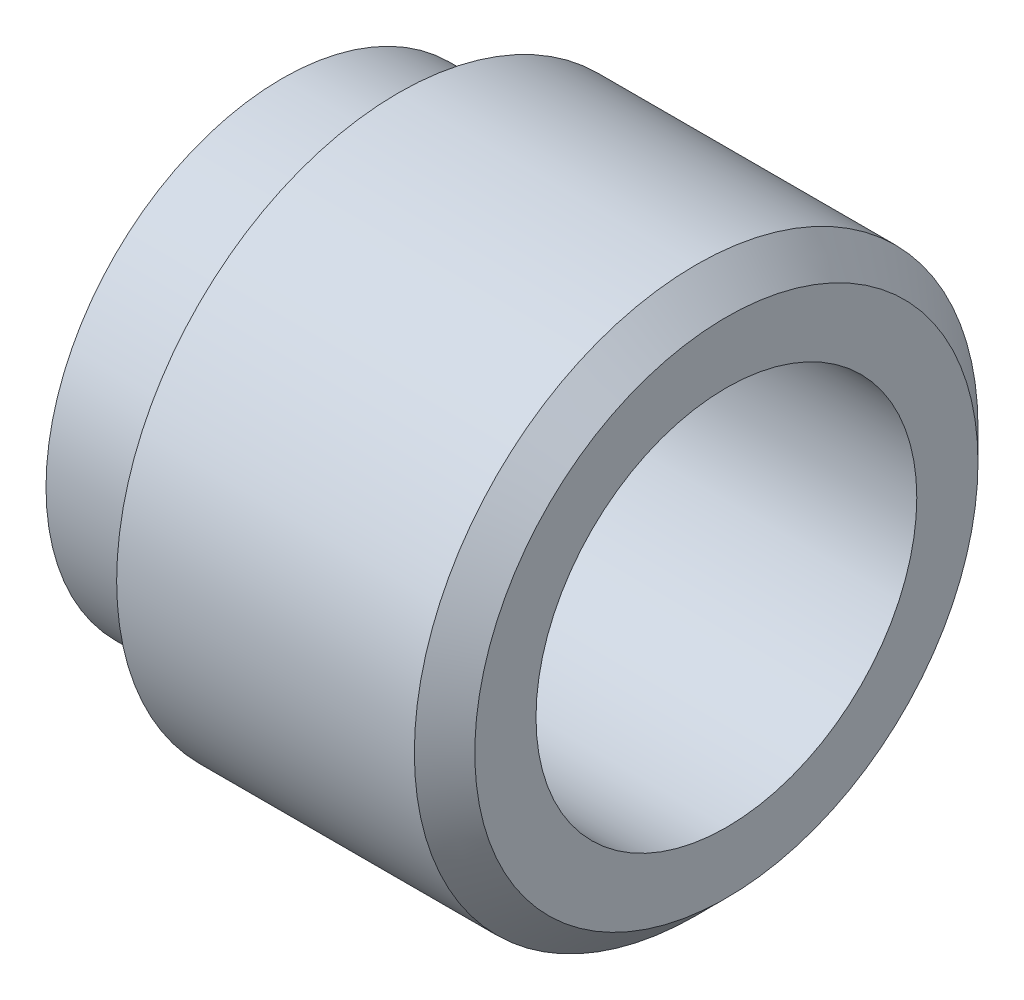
from build123d import *
from build123d.topology import SkipClean

# Parameters (mm, degrees)
SKETCH1_R           = 4.7371
SKETCH1_R_2         = 3.2004
BOSS_EXTRUDE1_DEPTH = 5.5118
CHAMFER1_SIZE       = 0.508
BOSS_EXTRUDE2_START = 1.9558
SKETCH2_R           = 3.96875
SKETCH2_R_2         = 3.2004
BOSS_EXTRUDE2_DEPTH = 1.9558


with BuildPart() as part:
    # Sketch1 → Boss-Extrude1 (new body)
    with BuildSketch(Plane(origin=(0, 0, 0), x_dir=(0, 0, -1), z_dir=(1, 0, 0))):
        Circle(SKETCH1_R)
        Circle(SKETCH1_R_2, mode=Mode.SUBTRACT)
    extrude(amount=BOSS_EXTRUDE1_DEPTH)

    # Chamfer1
    chamfer1_edges = [part.edges().sort_by_distance(p)[0] for p in [
        (5.5118, 0, 4.7371),
    ]]
    chamfer(chamfer1_edges, length=CHAMFER1_SIZE)

    # Sketch2 → Boss-Extrude2 (add)
    with SkipClean():  # the faces are left unmerged after this step: merging them gives an invalid solid
        with BuildSketch(Plane.ZY.offset(BOSS_EXTRUDE2_START)):
            with Locations(Location((0, 0, 0), (0, 0, 180))):
                Circle(SKETCH2_R)
            Circle(SKETCH2_R_2, mode=Mode.SUBTRACT)
        extrude(amount=-BOSS_EXTRUDE2_DEPTH)


solid = part.part
